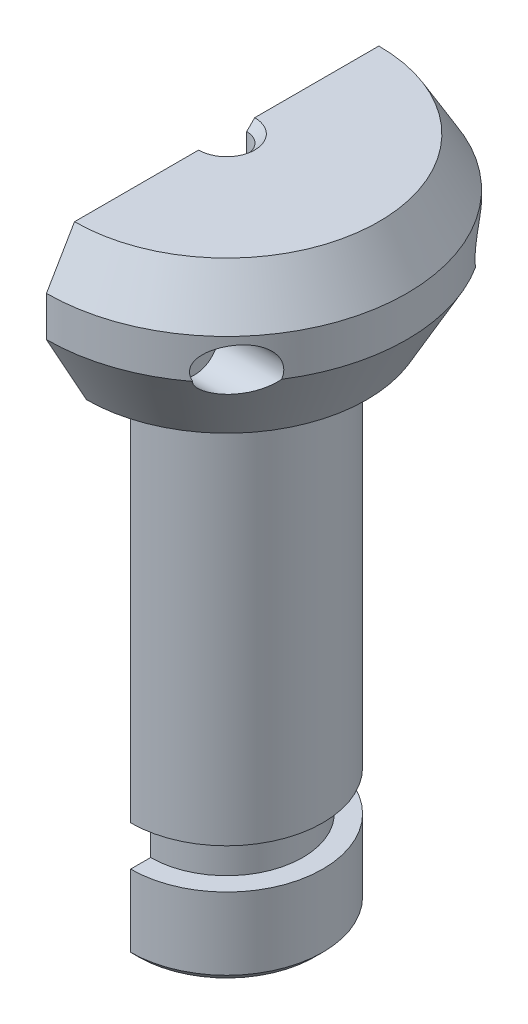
ISO-10303-21;
HEADER;
FILE_DESCRIPTION(('STEP AP214'),'2;1');
FILE_NAME('part.step','',(''),(''),'','','');
FILE_SCHEMA(('AUTOMOTIVE_DESIGN { 1 0 10303 214 1 1 1 1 }'));
ENDSEC;
DATA;
#1=APPLICATION_CONTEXT('core data for automotive mechanical design processes');
#2=APPLICATION_PROTOCOL_DEFINITION('international standard','automotive_design',2000,#1);
#3=PRODUCT_CONTEXT('',#1,'mechanical');
#4=PRODUCT('Part','Part','',(#3));
#5=PRODUCT_RELATED_PRODUCT_CATEGORY('part','',(#4));
#6=PRODUCT_DEFINITION_FORMATION('','',#4);
#7=PRODUCT_DEFINITION_CONTEXT('part definition',#1,'design');
#8=PRODUCT_DEFINITION('design','',#6,#7);
#9=PRODUCT_DEFINITION_SHAPE('','',#8);
#10=(LENGTH_UNIT() NAMED_UNIT(*) SI_UNIT(.MILLI.,.METRE.));
#11=(NAMED_UNIT(*) PLANE_ANGLE_UNIT() SI_UNIT($,.RADIAN.));
#12=(NAMED_UNIT(*) SI_UNIT($,.STERADIAN.) SOLID_ANGLE_UNIT());
#13=UNCERTAINTY_MEASURE_WITH_UNIT(LENGTH_MEASURE(1.E-05),#10,'distance_accuracy_value','');
#14=(GEOMETRIC_REPRESENTATION_CONTEXT(3) GLOBAL_UNCERTAINTY_ASSIGNED_CONTEXT((#13)) GLOBAL_UNIT_ASSIGNED_CONTEXT((#10,
#11,#12)) REPRESENTATION_CONTEXT('',''));
#15=CARTESIAN_POINT('',(0.,0.,0.));
#16=DIRECTION('',(0.,0.,1.));
#17=DIRECTION('',(1.,0.,0.));
#18=AXIS2_PLACEMENT_3D('',#15,#16,#17);
#19=CARTESIAN_POINT('',(0.,-127.,0.));
#20=DIRECTION('',(0.,1.,0.));
#21=DIRECTION('',(0.,0.,1.));
#22=AXIS2_PLACEMENT_3D('',#19,#20,#21);
#23=CYLINDRICAL_SURFACE('',#22,24.);
#24=DIRECTION('',(0.,1.,0.));
#25=VECTOR('',#24,1.);
#26=CARTESIAN_POINT('',(0.,-127.,24.));
#27=LINE('',#26,#25);
#28=CARTESIAN_POINT('',(0.,-125.,24.));
#29=VERTEX_POINT('',#28);
#30=CARTESIAN_POINT('',(0.,-107.,24.));
#31=VERTEX_POINT('',#30);
#32=EDGE_CURVE('E176',#29,#31,#27,.T.);
#33=ORIENTED_EDGE('',*,*,#32,.F.);
#34=CARTESIAN_POINT('',(0.,-125.,0.));
#35=DIRECTION('',(0.,-1.,0.));
#36=DIRECTION('',(0.,0.,-1.));
#37=AXIS2_PLACEMENT_3D('',#34,#35,#36);
#38=CIRCLE('',#37,24.);
#39=CARTESIAN_POINT('',(0.,-125.,-24.));
#40=VERTEX_POINT('',#39);
#41=EDGE_CURVE('E42',#29,#40,#38,.F.);
#42=ORIENTED_EDGE('',*,*,#41,.T.);
#43=DIRECTION('',(0.,1.,0.));
#44=VECTOR('',#43,1.);
#45=CARTESIAN_POINT('',(0.,-127.,-24.));
#46=LINE('',#45,#44);
#47=CARTESIAN_POINT('',(-1.6759110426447E-13,-107.,-24.));
#48=VERTEX_POINT('',#47);
#49=EDGE_CURVE('E200',#40,#48,#46,.T.);
#50=ORIENTED_EDGE('',*,*,#49,.T.);
#51=CARTESIAN_POINT('',(0.,-107.,0.));
#52=DIRECTION('',(0.,-1.,0.));
#53=DIRECTION('',(0.,0.,-1.));
#54=AXIS2_PLACEMENT_3D('',#51,#52,#53);
#55=CIRCLE('',#54,24.);
#56=EDGE_CURVE('E414',#48,#31,#55,.T.);
#57=ORIENTED_EDGE('',*,*,#56,.T.);
#58=EDGE_LOOP('',(#33,#42,#50,#57));
#59=FACE_BOUND('',#58,.T.);
#60=ADVANCED_FACE('F34',(#59),#23,.T.);
#61=CARTESIAN_POINT('',(0.,0.,0.));
#62=DIRECTION('',(0.,1.,0.));
#63=DIRECTION('',(0.,0.,1.));
#64=AXIS2_PLACEMENT_3D('',#61,#62,#63);
#65=PLANE('',#64);
#66=CARTESIAN_POINT('',(0.,0.,0.));
#67=DIRECTION('',(0.,-1.,0.));
#68=DIRECTION('',(0.,0.,-1.));
#69=AXIS2_PLACEMENT_3D('',#66,#67,#68);
#70=CIRCLE('',#69,24.);
#71=CARTESIAN_POINT('',(0.,0.,-24.));
#72=VERTEX_POINT('',#71);
#73=CARTESIAN_POINT('',(0.,0.,24.));
#74=VERTEX_POINT('',#73);
#75=EDGE_CURVE('E175',#72,#74,#70,.T.);
#76=ORIENTED_EDGE('',*,*,#75,.F.);
#77=DIRECTION('',(0.,0.,-1.));
#78=VECTOR('',#77,1.);
#79=CARTESIAN_POINT('',(0.,0.,-45.));
#80=LINE('',#79,#78);
#81=CARTESIAN_POINT('',(0.,0.,-35.));
#82=VERTEX_POINT('',#81);
#83=EDGE_CURVE('E210',#72,#82,#80,.T.);
#84=ORIENTED_EDGE('',*,*,#83,.T.);
#85=CARTESIAN_POINT('',(0.,0.,0.));
#86=DIRECTION('',(0.,1.,0.));
#87=DIRECTION('',(0.,0.,1.));
#88=AXIS2_PLACEMENT_3D('',#85,#86,#87);
#89=CIRCLE('',#88,35.);
#90=CARTESIAN_POINT('',(0.,0.,35.));
#91=VERTEX_POINT('',#90);
#92=EDGE_CURVE('E255',#82,#91,#89,.F.);
#93=ORIENTED_EDGE('',*,*,#92,.T.);
#94=EDGE_CURVE('E212',#91,#74,#80,.T.);
#95=ORIENTED_EDGE('',*,*,#94,.T.);
#96=EDGE_LOOP('',(#76,#84,#93,#95));
#97=FACE_BOUND('',#96,.T.);
#98=ADVANCED_FACE('F209',(#97),#65,.F.);
#99=CARTESIAN_POINT('',(0.,40.,0.));
#100=DIRECTION('',(0.,1.,0.));
#101=DIRECTION('',(0.,0.,1.));
#102=AXIS2_PLACEMENT_3D('',#99,#100,#101);
#103=PLANE('',#102);
#104=DIRECTION('',(0.,0.,-1.));
#105=VECTOR('',#104,1.);
#106=CARTESIAN_POINT('',(0.,40.,-45.));
#107=LINE('',#106,#105);
#108=CARTESIAN_POINT('',(0.,40.,-7.00000000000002));
#109=VERTEX_POINT('',#108);
#110=CARTESIAN_POINT('',(0.,40.,-38.));
#111=VERTEX_POINT('',#110);
#112=EDGE_CURVE('E201',#109,#111,#107,.T.);
#113=ORIENTED_EDGE('',*,*,#112,.F.);
#114=CARTESIAN_POINT('',(0.,40.,0.));
#115=DIRECTION('',(0.,1.,0.));
#116=DIRECTION('',(0.,0.,1.));
#117=AXIS2_PLACEMENT_3D('',#114,#115,#116);
#118=CIRCLE('',#117,7.00000000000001);
#119=CARTESIAN_POINT('',(0.,40.,7.));
#120=VERTEX_POINT('',#119);
#121=EDGE_CURVE('E186',#109,#120,#118,.F.);
#122=ORIENTED_EDGE('',*,*,#121,.T.);
#123=CARTESIAN_POINT('',(0.,40.,38.));
#124=VERTEX_POINT('',#123);
#125=EDGE_CURVE('E204',#124,#120,#107,.T.);
#126=ORIENTED_EDGE('',*,*,#125,.F.);
#127=CARTESIAN_POINT('',(0.,40.,0.));
#128=DIRECTION('',(0.,1.,0.));
#129=DIRECTION('',(0.,0.,1.));
#130=AXIS2_PLACEMENT_3D('',#127,#128,#129);
#131=CIRCLE('',#130,38.);
#132=EDGE_CURVE('E239',#124,#111,#131,.T.);
#133=ORIENTED_EDGE('',*,*,#132,.T.);
#134=EDGE_LOOP('',(#113,#122,#126,#133));
#135=FACE_BOUND('',#134,.T.);
#136=ADVANCED_FACE('F302',(#135),#103,.T.);
#137=CARTESIAN_POINT('',(0.,40.,0.));
#138=DIRECTION('',(0.,-1.,0.));
#139=DIRECTION('',(0.,0.,-1.));
#140=AXIS2_PLACEMENT_3D('',#137,#138,#139);
#141=CYLINDRICAL_SURFACE('',#140,45.);
#142=CARTESIAN_POINT('',(0.,18.0000000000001,0.));
#143=DIRECTION('',(0.,1.,0.));
#144=DIRECTION('',(0.,0.,1.));
#145=AXIS2_PLACEMENT_3D('',#142,#143,#144);
#146=CIRCLE('',#145,45.);
#147=CARTESIAN_POINT('',(37.9286734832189,18.0000000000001,24.2160221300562));
#148=VERTEX_POINT('',#147);
#149=CARTESIAN_POINT('',(37.9286734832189,18.0000000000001,-24.2160221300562));
#150=VERTEX_POINT('',#149);
#151=EDGE_CURVE('E254',#148,#150,#146,.T.);
#152=ORIENTED_EDGE('',*,*,#151,.T.);
#153=CARTESIAN_POINT('',(26.839254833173,20.,-36.12));
#154=CARTESIAN_POINT('',(26.839250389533,19.8728360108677,-36.1200028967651));
#155=CARTESIAN_POINT('',(26.8446033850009,19.7456986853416,-36.1160274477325));
#156=CARTESIAN_POINT('',(26.8658065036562,19.4927422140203,-36.1002579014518));
#157=CARTESIAN_POINT('',(26.8816605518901,19.3669235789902,-36.0884608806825));
#158=CARTESIAN_POINT('',(26.923345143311,19.1177161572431,-36.0573731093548));
#159=CARTESIAN_POINT('',(26.949190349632,18.9943312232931,-36.038071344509));
#160=CARTESIAN_POINT('',(27.0100242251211,18.7511265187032,-35.9924996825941));
#161=CARTESIAN_POINT('',(27.0450181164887,18.6313088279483,-35.9662258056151));
#162=CARTESIAN_POINT('',(27.1612811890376,18.2813795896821,-35.878602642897));
#163=CARTESIAN_POINT('',(27.2544376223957,18.0574369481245,-35.8080057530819));
#164=CARTESIAN_POINT('',(27.4648695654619,17.6293603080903,-35.6468570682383));
#165=CARTESIAN_POINT('',(27.5821543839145,17.4252339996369,-35.5562975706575));
#166=CARTESIAN_POINT('',(27.8106371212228,17.0733272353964,-35.3777529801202));
#167=CARTESIAN_POINT('',(27.9188360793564,16.9221673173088,-35.2924829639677));
#168=CARTESIAN_POINT('',(28.144276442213,16.632353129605,-35.1129672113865));
#169=CARTESIAN_POINT('',(28.2615227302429,16.4937057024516,-35.0187166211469));
#170=CARTESIAN_POINT('',(28.5031901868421,16.2281059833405,-34.8222983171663));
#171=CARTESIAN_POINT('',(28.6276280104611,16.1011827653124,-34.7201120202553));
#172=CARTESIAN_POINT('',(28.881776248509,15.8588361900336,-34.5089889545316));
#173=CARTESIAN_POINT('',(29.0114863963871,15.7434122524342,-34.4000525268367));
#174=CARTESIAN_POINT('',(29.3370237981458,15.4716831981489,-34.1233590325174));
#175=CARTESIAN_POINT('',(29.5351978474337,15.3217521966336,-33.9520791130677));
#176=CARTESIAN_POINT('',(29.9371580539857,15.0443994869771,-33.5981901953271));
#177=CARTESIAN_POINT('',(30.1409466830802,14.9169878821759,-33.4155761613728));
#178=CARTESIAN_POINT('',(30.5519134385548,14.6839776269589,-33.040249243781));
#179=CARTESIAN_POINT('',(30.7590935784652,14.5783924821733,-32.8475301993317));
#180=CARTESIAN_POINT('',(31.1748434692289,14.3889428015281,-32.4532159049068));
#181=CARTESIAN_POINT('',(31.3834130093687,14.3050750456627,-32.2516219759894));
#182=CARTESIAN_POINT('',(31.8050399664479,14.1576282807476,-31.8359700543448));
#183=CARTESIAN_POINT('',(32.0180944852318,14.094539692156,-31.6217349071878));
#184=CARTESIAN_POINT('',(32.4425806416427,13.9918635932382,-31.1860780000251));
#185=CARTESIAN_POINT('',(32.6540121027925,13.9522786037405,-30.9646554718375));
#186=CARTESIAN_POINT('',(33.0735626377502,13.8976226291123,-30.5161213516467));
#187=CARTESIAN_POINT('',(33.2816848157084,13.8825271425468,-30.2890156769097));
#188=CARTESIAN_POINT('',(33.6933198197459,13.8780557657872,-29.8304383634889));
#189=CARTESIAN_POINT('',(33.8968337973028,13.8886733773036,-29.598967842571));
#190=CARTESIAN_POINT('',(34.2569214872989,13.9322022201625,-29.1808714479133));
#191=CARTESIAN_POINT('',(34.4146270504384,13.9601425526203,-28.9946951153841));
#192=CARTESIAN_POINT('',(34.7252439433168,14.0341405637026,-28.6219538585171));
#193=CARTESIAN_POINT('',(34.878156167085,14.080194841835,-28.4353890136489));
#194=CARTESIAN_POINT('',(35.1781362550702,14.1912378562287,-28.0634241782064));
#195=CARTESIAN_POINT('',(35.3252086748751,14.2562114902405,-27.8780233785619));
#196=CARTESIAN_POINT('',(35.6125825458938,14.4059319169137,-27.5099696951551));
#197=CARTESIAN_POINT('',(35.7528853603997,14.4906747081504,-27.3273162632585));
#198=CARTESIAN_POINT('',(35.999110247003,14.662194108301,-27.0018014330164));
#199=CARTESIAN_POINT('',(36.1064208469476,14.7453852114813,-26.8580961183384));
#200=CARTESIAN_POINT('',(36.3152517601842,14.9253331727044,-26.5750521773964));
#201=CARTESIAN_POINT('',(36.4167732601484,15.0220872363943,-26.435712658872));
#202=CARTESIAN_POINT('',(36.6132847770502,15.2292419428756,-26.1628673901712));
#203=CARTESIAN_POINT('',(36.7082793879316,15.3396328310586,-26.0293575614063));
#204=CARTESIAN_POINT('',(36.8910910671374,15.5740803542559,-25.7696064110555));
#205=CARTESIAN_POINT('',(36.9789091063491,15.6981351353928,-25.643364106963));
#206=CARTESIAN_POINT('',(37.1339321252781,15.9398447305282,-25.4182384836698));
#207=CARTESIAN_POINT('',(37.2022454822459,16.0556276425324,-25.3181057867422));
#208=CARTESIAN_POINT('',(37.3327102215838,16.2965156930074,-25.1253316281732));
#209=CARTESIAN_POINT('',(37.3948626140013,16.4216192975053,-25.0326889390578));
#210=CARTESIAN_POINT('',(37.5125732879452,16.6807052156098,-24.8559475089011));
#211=CARTESIAN_POINT('',(37.5681304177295,16.8146890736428,-24.7718502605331));
#212=CARTESIAN_POINT('',(37.672178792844,17.0907914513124,-24.6133283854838));
#213=CARTESIAN_POINT('',(37.7206734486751,17.2329059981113,-24.5388990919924));
#214=CARTESIAN_POINT('',(37.8104768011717,17.5253085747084,-24.4003013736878));
#215=CARTESIAN_POINT('',(37.8517433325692,17.6756382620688,-24.3361933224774));
#216=CARTESIAN_POINT('',(37.926383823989,17.9826823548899,-24.2197068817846));
#217=CARTESIAN_POINT('',(37.9597576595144,18.1393968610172,-24.1673286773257));
#218=CARTESIAN_POINT('',(38.0182890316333,18.4579258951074,-24.0751466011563));
#219=CARTESIAN_POINT('',(38.0434492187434,18.6197387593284,-24.0353386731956));
#220=CARTESIAN_POINT('',(38.0853208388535,18.9471213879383,-23.9689358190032));
#221=CARTESIAN_POINT('',(38.1020331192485,19.1126907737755,-23.9423395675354));
#222=CARTESIAN_POINT('',(38.1256244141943,19.4296729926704,-23.904752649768));
#223=CARTESIAN_POINT('',(38.1333090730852,19.5808760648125,-23.892484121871));
#224=CARTESIAN_POINT('',(38.141616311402,19.8839689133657,-23.8792204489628));
#225=CARTESIAN_POINT('',(38.1422391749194,20.0358586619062,-23.8782248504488));
#226=CARTESIAN_POINT('',(38.1364184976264,20.3391101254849,-23.8875200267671));
#227=CARTESIAN_POINT('',(38.1299770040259,20.4904719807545,-23.8978075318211));
#228=CARTESIAN_POINT('',(38.1100840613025,20.7915583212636,-23.9295182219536));
#229=CARTESIAN_POINT('',(38.0966326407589,20.9412828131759,-23.9509413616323));
#230=CARTESIAN_POINT('',(38.063449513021,21.2325441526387,-24.0036401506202));
#231=CARTESIAN_POINT('',(38.0439657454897,21.3741800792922,-24.0345264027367));
#232=CARTESIAN_POINT('',(37.9987319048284,21.65401356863,-24.1059776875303));
#233=CARTESIAN_POINT('',(37.9729797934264,21.7922099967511,-24.1465458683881));
#234=CARTESIAN_POINT('',(37.915407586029,22.064216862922,-24.2368465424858));
#235=CARTESIAN_POINT('',(37.8835895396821,22.1980287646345,-24.2865759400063));
#236=CARTESIAN_POINT('',(37.8140890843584,22.4606064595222,-24.3946468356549));
#237=CARTESIAN_POINT('',(37.7764044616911,22.5893703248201,-24.4529915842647));
#238=CARTESIAN_POINT('',(37.6937539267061,22.8463487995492,-24.580213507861));
#239=CARTESIAN_POINT('',(37.6485517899,22.9743216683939,-24.6494258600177));
#240=CARTESIAN_POINT('',(37.5523723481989,23.2234478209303,-24.7957054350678));
#241=CARTESIAN_POINT('',(37.5013929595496,23.3445986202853,-24.8727754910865));
#242=CARTESIAN_POINT('',(37.3402824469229,23.6970009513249,-25.1145518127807));
#243=CARTESIAN_POINT('',(37.2219275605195,23.917361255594,-25.2899041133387));
#244=CARTESIAN_POINT('',(36.9522142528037,24.3484143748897,-25.6826107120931));
#245=CARTESIAN_POINT('',(36.7986636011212,24.5554271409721,-25.9024603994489));
#246=CARTESIAN_POINT('',(36.4717812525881,24.929271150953,-26.3607380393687));
#247=CARTESIAN_POINT('',(36.2984395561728,25.0960819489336,-26.5991753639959));
#248=CARTESIAN_POINT('',(35.9049631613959,25.4148062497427,-27.128574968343));
#249=CARTESIAN_POINT('',(35.681856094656,25.5595309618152,-27.4216403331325));
#250=CARTESIAN_POINT('',(35.2182487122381,25.7978263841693,-28.0145855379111));
#251=CARTESIAN_POINT('',(34.977737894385,25.8913659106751,-28.314469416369));
#252=CARTESIAN_POINT('',(34.4314532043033,26.0454858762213,-28.9775087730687));
#253=CARTESIAN_POINT('',(34.1226013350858,26.0949780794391,-29.3406901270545));
#254=CARTESIAN_POINT('',(33.49175925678,26.1302816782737,-30.058790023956));
#255=CARTESIAN_POINT('',(33.1697592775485,26.1160448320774,-30.4137021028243));
#256=CARTESIAN_POINT('',(32.646312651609,26.0459712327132,-30.9726080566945));
#257=CARTESIAN_POINT('',(32.4470837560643,26.0086272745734,-31.1812296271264));
#258=CARTESIAN_POINT('',(32.0470640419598,25.9130179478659,-31.5922114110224));
#259=CARTESIAN_POINT('',(31.8462729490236,25.8547488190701,-31.7945704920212));
#260=CARTESIAN_POINT('',(31.4442761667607,25.7177740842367,-32.1921968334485));
#261=CARTESIAN_POINT('',(31.2430702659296,25.6390497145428,-32.3874573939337));
#262=CARTESIAN_POINT('',(30.8418210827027,25.4614209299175,-32.7697852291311));
#263=CARTESIAN_POINT('',(30.6417776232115,25.3625196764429,-32.9568537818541));
#264=CARTESIAN_POINT('',(30.2667310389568,25.1566338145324,-33.3013870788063));
#265=CARTESIAN_POINT('',(30.0914352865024,25.0517990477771,-33.4598192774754));
#266=CARTESIAN_POINT('',(29.7443530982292,24.8257316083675,-33.7687343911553));
#267=CARTESIAN_POINT('',(29.5725671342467,24.7044967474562,-33.9192162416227));
#268=CARTESIAN_POINT('',(29.2345361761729,24.4452242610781,-34.2109870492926));
#269=CARTESIAN_POINT('',(29.0682823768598,24.3072151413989,-34.3522909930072));
#270=CARTESIAN_POINT('',(28.7433761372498,24.0134184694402,-34.6246047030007));
#271=CARTESIAN_POINT('',(28.5847196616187,23.8576405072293,-34.7556199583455));
#272=CARTESIAN_POINT('',(28.2434569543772,23.4899744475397,-35.0337793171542));
#273=CARTESIAN_POINT('',(28.0634581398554,23.2733373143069,-35.1779521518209));
#274=CARTESIAN_POINT('',(27.7273109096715,22.8096115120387,-35.4435041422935));
#275=CARTESIAN_POINT('',(27.5711319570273,22.5625625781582,-35.5649125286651));
#276=CARTESIAN_POINT('',(27.3254155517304,22.0964796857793,-35.7538825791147));
#277=CARTESIAN_POINT('',(27.2287933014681,21.8837152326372,-35.8274127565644));
#278=CARTESIAN_POINT('',(27.1050637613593,21.5522101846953,-35.9209993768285));
#279=CARTESIAN_POINT('',(27.0673688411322,21.4397112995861,-35.9493995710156));
#280=CARTESIAN_POINT('',(26.9998711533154,21.2110527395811,-36.0001213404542));
#281=CARTESIAN_POINT('',(26.9700658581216,21.0948942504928,-36.0224448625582));
#282=CARTESIAN_POINT('',(26.9101966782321,20.8181489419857,-36.0672038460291));
#283=CARTESIAN_POINT('',(26.8837321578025,20.6563111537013,-36.0869146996));
#284=CARTESIAN_POINT('',(26.8482637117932,20.3296340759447,-36.1133112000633));
#285=CARTESIAN_POINT('',(26.839260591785,20.1647946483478,-36.1199962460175));
#286=CARTESIAN_POINT('',(26.839254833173,20.,-36.12));
#287=B_SPLINE_CURVE_WITH_KNOTS('',3,(#153,#154,#155,#156,#157,#158,#159,#160,#161,#162,#163,
#164,#165,#166,#167,#168,#169,#170,#171,#172,#173,#174,#175,#176,#177,#178,#179,#180,#181,#182,
#183,#184,#185,#186,#187,#188,#189,#190,#191,#192,#193,#194,#195,#196,#197,#198,#199,#200,#201,
#202,#203,#204,#205,#206,#207,#208,#209,#210,#211,#212,#213,#214,#215,#216,#217,#218,#219,#220,
#221,#222,#223,#224,#225,#226,#227,#228,#229,#230,#231,#232,#233,#234,#235,#236,#237,#238,#239,
#240,#241,#242,#243,#244,#245,#246,#247,#248,#249,#250,#251,#252,#253,#254,#255,#256,#257,#258,
#259,#260,#261,#262,#263,#264,#265,#266,#267,#268,#269,#270,#271,#272,#273,#274,#275,#276,#277,
#278,#279,#280,#281,#282,#283,#284,#285,#286),.UNSPECIFIED.,.T.,.F.,(4,2,2,2,2,2,2,2,2,2,2,2,2,
2,2,2,2,2,2,2,2,2,2,2,2,2,2,2,2,2,2,2,2,2,2,2,2,2,2,2,2,2,2,2,2,2,2,2,2,2,2,2,2,2,2,2,2,2,2,2,2,
2,2,2,2,2,4),(0.,0.381274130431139,0.762690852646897,1.14466948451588,1.52686663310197,
2.28109690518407,3.03561870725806,3.64833044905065,4.26137524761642,4.87590161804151,
5.49039695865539,6.39453131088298,7.29907027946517,8.20416728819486,9.10913002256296,
10.0341330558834,10.9592352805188,11.8834113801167,12.8073539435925,13.5434669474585,
14.279441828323,15.0148308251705,15.7500711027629,16.342641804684,16.9350905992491,
17.5271180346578,18.1190652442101,18.6214433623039,19.1237389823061,19.6261221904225,
20.1282619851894,20.6332399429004,21.1382258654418,21.6430486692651,22.1478208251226,
22.6029335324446,23.0580279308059,23.5129904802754,23.9679511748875,24.406256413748,
24.8447043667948,25.2830044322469,25.721470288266,26.1780222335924,26.6347393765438,
27.547624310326,28.5601432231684,29.573176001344,30.7560835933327,31.9397110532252,
33.3725835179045,34.8065408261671,35.6784428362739,36.5505016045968,37.4233631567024,
38.2960880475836,39.0709555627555,39.8459265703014,40.6195985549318,41.392854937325,
42.3395078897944,43.2849368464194,44.0168954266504,44.382489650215,44.7479666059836,
45.2420454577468,45.73614710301),.UNSPECIFIED.);
#288=CARTESIAN_POINT('',(27.2856542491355,18.0000000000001,-35.7839778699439));
#289=VERTEX_POINT('',#288);
#290=EDGE_CURVE('E307',#150,#289,#287,.T.);
#291=ORIENTED_EDGE('',*,*,#290,.T.);
#292=CARTESIAN_POINT('',(0.,18.0000000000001,-45.));
#293=VERTEX_POINT('',#292);
#294=EDGE_CURVE('E250',#289,#293,#146,.T.);
#295=ORIENTED_EDGE('',*,*,#294,.T.);
#296=DIRECTION('',(0.,1.,0.));
#297=VECTOR('',#296,1.);
#298=CARTESIAN_POINT('',(0.,0.,-45.));
#299=LINE('',#298,#297);
#300=CARTESIAN_POINT('',(0.,27.9999999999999,-45.));
#301=VERTEX_POINT('',#300);
#302=EDGE_CURVE('E230',#293,#301,#299,.T.);
#303=ORIENTED_EDGE('',*,*,#302,.T.);
#304=CARTESIAN_POINT('',(0.,27.9999999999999,0.));
#305=DIRECTION('',(0.,1.,0.));
#306=DIRECTION('',(0.,0.,1.));
#307=AXIS2_PLACEMENT_3D('',#304,#305,#306);
#308=CIRCLE('',#307,45.);
#309=CARTESIAN_POINT('',(0.,27.9999999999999,45.));
#310=VERTEX_POINT('',#309);
#311=EDGE_CURVE('E245',#301,#310,#308,.F.);
#312=ORIENTED_EDGE('',*,*,#311,.T.);
#313=DIRECTION('',(0.,1.,0.));
#314=VECTOR('',#313,1.);
#315=CARTESIAN_POINT('',(0.,0.,45.));
#316=LINE('',#315,#314);
#317=CARTESIAN_POINT('',(0.,18.0000000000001,45.));
#318=VERTEX_POINT('',#317);
#319=EDGE_CURVE('E220',#318,#310,#316,.T.);
#320=ORIENTED_EDGE('',*,*,#319,.F.);
#321=CARTESIAN_POINT('',(27.2856542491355,18.0000000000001,35.7839778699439));
#322=VERTEX_POINT('',#321);
#323=EDGE_CURVE('E251',#318,#322,#146,.T.);
#324=ORIENTED_EDGE('',*,*,#323,.T.);
#325=CARTESIAN_POINT('',(38.1411274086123,20.,23.88));
#326=CARTESIAN_POINT('',(38.1411279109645,19.8485614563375,23.8799988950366));
#327=CARTESIAN_POINT('',(38.1376061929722,19.6971363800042,23.8856267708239));
#328=CARTESIAN_POINT('',(38.1235474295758,19.3953916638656,23.9080595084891));
#329=CARTESIAN_POINT('',(38.1130082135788,19.2450723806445,23.9248678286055));
#330=CARTESIAN_POINT('',(38.0849844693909,18.9465809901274,23.9694524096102));
#331=CARTESIAN_POINT('',(38.0674932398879,18.79841109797,23.9972392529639));
#332=CARTESIAN_POINT('',(38.0256984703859,18.5053794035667,24.0634117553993));
#333=CARTESIAN_POINT('',(38.0013922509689,18.3605189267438,24.1018015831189));
#334=CARTESIAN_POINT('',(37.9462563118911,18.0756467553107,24.1885150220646));
#335=CARTESIAN_POINT('',(37.9154493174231,17.9356200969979,24.236804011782));
#336=CARTESIAN_POINT('',(37.8474814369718,17.6607167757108,24.3428040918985));
#337=CARTESIAN_POINT('',(37.8103181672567,17.5258420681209,24.4005187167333));
#338=CARTESIAN_POINT('',(37.7299351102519,17.2621276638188,24.5246295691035));
#339=CARTESIAN_POINT('',(37.6867186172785,17.1332847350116,24.5910210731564));
#340=CARTESIAN_POINT('',(37.5944936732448,16.8821431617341,24.7317837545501));
#341=CARTESIAN_POINT('',(37.5454830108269,16.7598470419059,24.8061579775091));
#342=CARTESIAN_POINT('',(37.4396687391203,16.5170191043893,24.9655913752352));
#343=CARTESIAN_POINT('',(37.3826139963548,16.3968131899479,25.0509804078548));
#344=CARTESIAN_POINT('',(37.2629067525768,16.1645726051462,25.2286997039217));
#345=CARTESIAN_POINT('',(37.2002522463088,16.052540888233,25.3210324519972));
#346=CARTESIAN_POINT('',(37.0044778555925,15.7292620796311,25.6070656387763));
#347=CARTESIAN_POINT('',(36.863482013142,15.5306831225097,25.8098998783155));
#348=CARTESIAN_POINT('',(36.5431708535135,15.1439992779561,26.2618252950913));
#349=CARTESIAN_POINT('',(36.3612521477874,14.9610621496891,26.5134458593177));
#350=CARTESIAN_POINT('',(35.9784429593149,14.6399620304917,27.0306342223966));
#351=CARTESIAN_POINT('',(35.7775358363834,14.5018387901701,27.2962141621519));
#352=CARTESIAN_POINT('',(35.4171245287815,14.3001450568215,27.7612885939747));
#353=CARTESIAN_POINT('',(35.2611080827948,14.2265145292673,27.9592418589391));
#354=CARTESIAN_POINT('',(34.9422738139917,14.1010689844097,28.3566987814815));
#355=CARTESIAN_POINT('',(34.7794535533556,14.0492618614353,28.5562029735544));
#356=CARTESIAN_POINT('',(34.4481100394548,13.9664255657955,28.9550519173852));
#357=CARTESIAN_POINT('',(34.2795816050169,13.9354158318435,29.1543963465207));
#358=CARTESIAN_POINT('',(33.9380436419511,13.8932116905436,29.5512729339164));
#359=CARTESIAN_POINT('',(33.7650344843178,13.8820156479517,29.7488052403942));
#360=CARTESIAN_POINT('',(33.413217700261,13.878458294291,30.1434517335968));
#361=CARTESIAN_POINT('',(33.2343638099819,13.8863455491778,30.3405265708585));
#362=CARTESIAN_POINT('',(32.8740050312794,13.9206126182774,30.7306087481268));
#363=CARTESIAN_POINT('',(32.6924999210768,13.9469939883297,30.9236157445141));
#364=CARTESIAN_POINT('',(32.3275763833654,14.0175889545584,31.3049120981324));
#365=CARTESIAN_POINT('',(32.144156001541,14.0618229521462,31.4931957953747));
#366=CARTESIAN_POINT('',(31.7766153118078,14.1675866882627,31.8640058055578));
#367=CARTESIAN_POINT('',(31.592495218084,14.2291114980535,32.0465337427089));
#368=CARTESIAN_POINT('',(31.1877267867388,14.383139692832,32.4410335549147));
#369=CARTESIAN_POINT('',(30.9671247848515,14.4793755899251,32.6516081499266));
#370=CARTESIAN_POINT('',(30.5281191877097,14.6962373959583,33.0624312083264));
#371=CARTESIAN_POINT('',(30.3097164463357,14.8168724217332,33.2626757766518));
#372=CARTESIAN_POINT('',(29.8778931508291,15.0827570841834,33.6510870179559));
#373=CARTESIAN_POINT('',(29.664465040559,15.2279661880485,33.8392728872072));
#374=CARTESIAN_POINT('',(29.2454727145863,15.5440866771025,34.2020324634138));
#375=CARTESIAN_POINT('',(29.0399023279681,15.7149773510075,34.3766169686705));
#376=CARTESIAN_POINT('',(28.6264608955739,16.0974235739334,34.7217974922));
#377=CARTESIAN_POINT('',(28.4194682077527,16.3110081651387,34.8912244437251));
#378=CARTESIAN_POINT('',(28.0271000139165,16.7723434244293,35.2071702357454));
#379=CARTESIAN_POINT('',(27.8416944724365,17.0200455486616,35.3537210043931));
#380=CARTESIAN_POINT('',(27.5415528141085,17.4931303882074,35.5877904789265));
#381=CARTESIAN_POINT('',(27.4202517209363,17.7113664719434,35.6811988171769));
#382=CARTESIAN_POINT('',(27.2059520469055,18.1694777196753,35.8448653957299));
#383=CARTESIAN_POINT('',(27.1129082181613,18.4093174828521,35.9151606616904));
#384=CARTESIAN_POINT('',(26.9785965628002,18.8585507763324,36.0161218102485));
#385=CARTESIAN_POINT('',(26.9307868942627,19.0648278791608,36.0518294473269));
#386=CARTESIAN_POINT('',(26.8636330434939,19.4844793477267,36.1018979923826));
#387=CARTESIAN_POINT('',(26.8442636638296,19.6978472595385,36.1162777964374));
#388=CARTESIAN_POINT('',(26.8359528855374,20.1259495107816,36.1224538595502));
#389=CARTESIAN_POINT('',(26.8470720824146,20.3406857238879,36.1142051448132));
#390=CARTESIAN_POINT('',(26.8986700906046,20.7645981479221,36.075788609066));
#391=CARTESIAN_POINT('',(26.9391705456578,20.9737701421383,36.045604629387));
#392=CARTESIAN_POINT('',(27.0571996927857,21.4250206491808,35.957118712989));
#393=CARTESIAN_POINT('',(27.140789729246,21.6645846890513,35.8941879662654));
#394=CARTESIAN_POINT('',(27.3371294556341,22.1235091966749,35.7448818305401));
#395=CARTESIAN_POINT('',(27.449931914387,22.3428321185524,35.6584640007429));
#396=CARTESIAN_POINT('',(27.7543610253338,22.8574822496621,35.422412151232));
#397=CARTESIAN_POINT('',(27.958232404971,23.1406411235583,35.2620800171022));
#398=CARTESIAN_POINT('',(28.2847312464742,23.5327136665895,34.9999128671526));
#399=CARTESIAN_POINT('',(28.3971951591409,23.6581219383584,34.9087608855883));
#400=CARTESIAN_POINT('',(28.6276724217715,23.8986329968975,34.7200009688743));
#401=CARTESIAN_POINT('',(28.7456856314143,24.0137360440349,34.6223931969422));
#402=CARTESIAN_POINT('',(29.0470149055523,24.2900249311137,34.3704330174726));
#403=CARTESIAN_POINT('',(29.2330536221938,24.4449217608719,34.2124404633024));
#404=CARTESIAN_POINT('',(29.6116645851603,24.7335623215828,33.885277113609));
#405=CARTESIAN_POINT('',(29.804239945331,24.8672957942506,33.7161009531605));
#406=CARTESIAN_POINT('',(30.1936692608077,25.1144790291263,33.367808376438));
#407=CARTESIAN_POINT('',(30.3905264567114,25.227912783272,33.1886842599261));
#408=CARTESIAN_POINT('',(30.7865013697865,25.4347717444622,32.821703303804));
#409=CARTESIAN_POINT('',(30.9856187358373,25.5282000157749,32.6338478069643));
#410=CARTESIAN_POINT('',(31.3906952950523,25.6976496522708,32.2444653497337));
#411=CARTESIAN_POINT('',(31.5966788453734,25.7730571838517,32.0426965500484));
#412=CARTESIAN_POINT('',(32.0080597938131,25.9023838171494,31.6317663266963));
#413=CARTESIAN_POINT('',(32.2134571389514,25.9563010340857,31.4226042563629));
#414=CARTESIAN_POINT('',(32.6221763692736,26.0419460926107,30.9980704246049));
#415=CARTESIAN_POINT('',(32.825499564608,26.0736889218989,30.7827029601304));
#416=CARTESIAN_POINT('',(33.2288830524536,26.1140827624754,30.3468196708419));
#417=CARTESIAN_POINT('',(33.4289438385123,26.1227372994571,30.126304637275));
#418=CARTESIAN_POINT('',(33.7987921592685,26.1162076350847,29.7104148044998));
#419=CARTESIAN_POINT('',(33.9691396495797,26.1039707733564,29.5154903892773));
#420=CARTESIAN_POINT('',(34.3054151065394,26.0601775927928,29.1239602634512));
#421=CARTESIAN_POINT('',(34.4713430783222,26.0286212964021,28.9273545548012));
#422=CARTESIAN_POINT('',(34.7976113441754,25.9452288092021,28.5340407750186));
#423=CARTESIAN_POINT('',(34.9579559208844,25.8934085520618,28.3373329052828));
#424=CARTESIAN_POINT('',(35.2720434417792,25.7684781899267,27.945410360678));
#425=CARTESIAN_POINT('',(35.4257878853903,25.6953729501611,27.7501953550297));
#426=CARTESIAN_POINT('',(35.6947449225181,25.5441872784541,27.4029758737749));
#427=CARTESIAN_POINT('',(35.8114022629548,25.4701892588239,27.2503068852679));
#428=CARTESIAN_POINT('',(36.0390629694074,25.3077398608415,26.9484997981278));
#429=CARTESIAN_POINT('',(36.1500675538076,25.2192916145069,26.7993609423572));
#430=CARTESIAN_POINT('',(36.3656133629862,25.0277192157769,26.5061361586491));
#431=CARTESIAN_POINT('',(36.4701599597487,24.924607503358,26.3620460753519));
#432=CARTESIAN_POINT('',(36.6721032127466,24.7035211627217,26.0803922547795));
#433=CARTESIAN_POINT('',(36.7695009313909,24.5855487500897,25.9428275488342));
#434=CARTESIAN_POINT('',(36.941276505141,24.3550388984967,25.6974858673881));
#435=CARTESIAN_POINT('',(37.0168353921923,24.2446864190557,25.5884797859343));
#436=CARTESIAN_POINT('',(37.1618486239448,24.0138010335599,25.3774189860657));
#437=CARTESIAN_POINT('',(37.2313039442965,23.89326976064,25.2753631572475));
#438=CARTESIAN_POINT('',(37.3636387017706,23.6423485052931,25.0793241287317));
#439=CARTESIAN_POINT('',(37.4265163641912,23.5119558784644,24.9853431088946));
#440=CARTESIAN_POINT('',(37.5451846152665,23.2418946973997,24.806664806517));
#441=CARTESIAN_POINT('',(37.6009752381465,23.1022261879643,24.7219674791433));
#442=CARTESIAN_POINT('',(37.7053580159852,22.8133808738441,24.5624740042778));
#443=CARTESIAN_POINT('',(37.7538980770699,22.6641453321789,24.4877498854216));
#444=CARTESIAN_POINT('',(37.8428699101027,22.3580479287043,24.3500292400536));
#445=CARTESIAN_POINT('',(37.8833026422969,22.2011869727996,24.2870313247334));
#446=CARTESIAN_POINT('',(37.9556143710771,21.8813040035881,24.1738669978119));
#447=CARTESIAN_POINT('',(37.9875080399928,21.7182931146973,24.1236785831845));
#448=CARTESIAN_POINT('',(38.0424987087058,21.3873308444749,24.0368661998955));
#449=CARTESIAN_POINT('',(38.0656000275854,21.2193819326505,24.0002355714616));
#450=CARTESIAN_POINT('',(38.1031019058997,20.8771514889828,23.9406535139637));
#451=CARTESIAN_POINT('',(38.117348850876,20.7028109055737,23.9179436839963));
#452=CARTESIAN_POINT('',(38.1363610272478,20.3523074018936,23.8876180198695));
#453=CARTESIAN_POINT('',(38.1411268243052,20.1761445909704,23.8800012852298));
#454=CARTESIAN_POINT('',(38.1411274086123,20.,23.88));
#455=B_SPLINE_CURVE_WITH_KNOTS('',3,(#325,#326,#327,#328,#329,#330,#331,#332,#333,#334,#335,
#336,#337,#338,#339,#340,#341,#342,#343,#344,#345,#346,#347,#348,#349,#350,#351,#352,#353,#354,
#355,#356,#357,#358,#359,#360,#361,#362,#363,#364,#365,#366,#367,#368,#369,#370,#371,#372,#373,
#374,#375,#376,#377,#378,#379,#380,#381,#382,#383,#384,#385,#386,#387,#388,#389,#390,#391,#392,
#393,#394,#395,#396,#397,#398,#399,#400,#401,#402,#403,#404,#405,#406,#407,#408,#409,#410,#411,
#412,#413,#414,#415,#416,#417,#418,#419,#420,#421,#422,#423,#424,#425,#426,#427,#428,#429,#430,
#431,#432,#433,#434,#435,#436,#437,#438,#439,#440,#441,#442,#443,#444,#445,#446,#447,#448,#449,
#450,#451,#452,#453,#454),.UNSPECIFIED.,.T.,.F.,(4,2,2,2,2,2,2,2,2,2,2,2,2,2,2,2,2,2,2,2,2,2,2,
2,2,2,2,2,2,2,2,2,2,2,2,2,2,2,2,2,2,2,2,2,2,2,2,2,2,2,2,2,2,2,2,2,2,2,2,2,2,2,2,2,4),(0.,
0.454147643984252,0.9084358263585,1.36316298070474,1.81806916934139,2.27141070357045,
2.72492262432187,3.17818868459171,3.63162829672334,4.10543218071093,4.57940641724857,
5.52679163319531,6.60405158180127,7.68226448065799,8.46903228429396,9.25608444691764,
10.0438712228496,10.8315929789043,11.6296301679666,12.4277345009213,13.2267534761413,
14.025544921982,14.9838183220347,15.9424504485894,16.8995165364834,17.8558148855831,
18.8802030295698,19.9031484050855,20.7002436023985,21.4960556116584,22.1375260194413,
22.7784277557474,23.4206041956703,24.0632541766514,24.8431723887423,25.6245093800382,
26.7697000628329,27.34400243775,27.9182902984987,28.78427680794,29.6506818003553,
30.5177670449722,31.3847193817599,32.2779640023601,33.1712869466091,34.064005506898,
34.9565877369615,35.7333589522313,36.5101292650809,37.2862900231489,38.0622735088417,
38.6793969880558,39.2963868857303,39.9128564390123,40.529234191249,41.0463367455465,
41.5633564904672,42.0805153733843,42.5976717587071,43.118381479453,43.6390294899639,
44.1587770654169,44.6782689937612,45.2065388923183,45.7347772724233),.UNSPECIFIED.);
#456=EDGE_CURVE('E213',#322,#148,#455,.T.);
#457=ORIENTED_EDGE('',*,*,#456,.T.);
#458=EDGE_LOOP('',(#152,#291,#295,#303,#312,#320,#324,#457));
#459=FACE_BOUND('',#458,.T.);
#460=ADVANCED_FACE('F297',(#459),#141,.T.);
#461=CARTESIAN_POINT('',(0.,40.,0.));
#462=DIRECTION('',(0.,-1.,0.));
#463=DIRECTION('',(0.,0.,-1.));
#464=AXIS2_PLACEMENT_3D('',#461,#462,#463);
#465=CYLINDRICAL_SURFACE('',#464,5.);
#466=DIRECTION('',(0.,-1.,0.));
#467=VECTOR('',#466,1.);
#468=CARTESIAN_POINT('',(0.,40.,-5.));
#469=LINE('',#468,#467);
#470=CARTESIAN_POINT('',(0.,-125.,-5.));
#471=VERTEX_POINT('',#470);
#472=CARTESIAN_POINT('',(0.,38.,-5.));
#473=VERTEX_POINT('',#472);
#474=EDGE_CURVE('E232',#471,#473,#469,.F.);
#475=ORIENTED_EDGE('',*,*,#474,.F.);
#476=CARTESIAN_POINT('',(0.,-125.,0.));
#477=DIRECTION('',(0.,-1.,0.));
#478=DIRECTION('',(0.,0.,-1.));
#479=AXIS2_PLACEMENT_3D('',#476,#477,#478);
#480=CIRCLE('',#479,5.);
#481=CARTESIAN_POINT('',(0.,-125.,4.99999999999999));
#482=VERTEX_POINT('',#481);
#483=EDGE_CURVE('E385',#471,#482,#480,.T.);
#484=ORIENTED_EDGE('',*,*,#483,.T.);
#485=DIRECTION('',(0.,-1.,0.));
#486=VECTOR('',#485,1.);
#487=CARTESIAN_POINT('',(0.,40.,5.));
#488=LINE('',#487,#486);
#489=CARTESIAN_POINT('',(0.,38.,5.));
#490=VERTEX_POINT('',#489);
#491=EDGE_CURVE('E236',#490,#482,#488,.T.);
#492=ORIENTED_EDGE('',*,*,#491,.F.);
#493=CARTESIAN_POINT('',(0.,38.,0.));
#494=DIRECTION('',(0.,1.,0.));
#495=DIRECTION('',(0.,0.,1.));
#496=AXIS2_PLACEMENT_3D('',#493,#494,#495);
#497=CIRCLE('',#496,5.);
#498=EDGE_CURVE('E389',#490,#473,#497,.T.);
#499=ORIENTED_EDGE('',*,*,#498,.T.);
#500=EDGE_LOOP('',(#475,#484,#492,#499));
#501=FACE_BOUND('',#500,.T.);
#502=ADVANCED_FACE('F301',(#501),#465,.F.);
#503=CARTESIAN_POINT('',(0.,0.,-45.));
#504=DIRECTION('',(1.,0.,0.));
#505=DIRECTION('',(0.,0.,-1.));
#506=AXIS2_PLACEMENT_3D('',#503,#504,#505);
#507=PLANE('',#506);
#508=CARTESIAN_POINT('',(0.,20.,-30.));
#509=DIRECTION('',(1.,0.,0.));
#510=DIRECTION('',(0.,0.,-1.));
#511=AXIS2_PLACEMENT_3D('',#508,#509,#510);
#512=CIRCLE('',#511,2.9);
#513=CARTESIAN_POINT('',(0.,20.,-32.9));
#514=VERTEX_POINT('',#513);
#515=EDGE_CURVE('E419',#514,#514,#512,.T.);
#516=ORIENTED_EDGE('',*,*,#515,.T.);
#517=EDGE_LOOP('',(#516));
#518=FACE_BOUND('',#517,.T.);
#519=ORIENTED_EDGE('',*,*,#49,.F.);
#520=DIRECTION('',(0.,0.707106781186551,-0.707106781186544));
#521=VECTOR('',#520,1.);
#522=CARTESIAN_POINT('',(0.,-149.,0.));
#523=LINE('',#522,#521);
#524=CARTESIAN_POINT('',(0.,-127.,-22.));
#525=VERTEX_POINT('',#524);
#526=EDGE_CURVE('E11',#40,#525,#523,.F.);
#527=ORIENTED_EDGE('',*,*,#526,.T.);
#528=DIRECTION('',(0.,0.,-1.));
#529=VECTOR('',#528,1.);
#530=CARTESIAN_POINT('',(0.,-127.,-5.));
#531=LINE('',#530,#529);
#532=CARTESIAN_POINT('',(0.,-127.,-6.99999999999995));
#533=VERTEX_POINT('',#532);
#534=EDGE_CURVE('E181',#533,#525,#531,.T.);
#535=ORIENTED_EDGE('',*,*,#534,.F.);
#536=DIRECTION('',(0.,0.707106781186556,0.707106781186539));
#537=VECTOR('',#536,1.);
#538=CARTESIAN_POINT('',(0.,-120.,0.));
#539=LINE('',#538,#537);
#540=EDGE_CURVE('E392',#533,#471,#539,.T.);
#541=ORIENTED_EDGE('',*,*,#540,.T.);
#542=ORIENTED_EDGE('',*,*,#474,.T.);
#543=DIRECTION('',(0.,0.707106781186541,-0.707106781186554));
#544=VECTOR('',#543,1.);
#545=CARTESIAN_POINT('',(0.,33.0000000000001,0.));
#546=LINE('',#545,#544);
#547=EDGE_CURVE('E394',#473,#109,#546,.T.);
#548=ORIENTED_EDGE('',*,*,#547,.T.);
#549=ORIENTED_EDGE('',*,*,#112,.T.);
#550=DIRECTION('',(0.,0.863778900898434,0.503871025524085));
#551=VECTOR('',#550,1.);
#552=CARTESIAN_POINT('',(0.,105.142857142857,0.));
#553=LINE('',#552,#551);
#554=EDGE_CURVE('E242',#111,#301,#553,.F.);
#555=ORIENTED_EDGE('',*,*,#554,.T.);
#556=ORIENTED_EDGE('',*,*,#302,.F.);
#557=DIRECTION('',(0.,0.874157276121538,-0.485642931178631));
#558=VECTOR('',#557,1.);
#559=CARTESIAN_POINT('',(0.,-63.0000000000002,0.));
#560=LINE('',#559,#558);
#561=EDGE_CURVE('E217',#293,#82,#560,.F.);
#562=ORIENTED_EDGE('',*,*,#561,.T.);
#563=ORIENTED_EDGE('',*,*,#83,.F.);
#564=CARTESIAN_POINT('',(0.,-97.,-24.));
#565=VERTEX_POINT('',#564);
#566=EDGE_CURVE('E179',#565,#72,#46,.T.);
#567=ORIENTED_EDGE('',*,*,#566,.F.);
#568=DIRECTION('',(0.,0.,1.));
#569=VECTOR('',#568,1.);
#570=CARTESIAN_POINT('',(-1.6759110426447E-13,-97.,-24.));
#571=LINE('',#570,#569);
#572=CARTESIAN_POINT('',(-1.32676290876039E-13,-97.,-19.));
#573=VERTEX_POINT('',#572);
#574=EDGE_CURVE('E157',#565,#573,#571,.T.);
#575=ORIENTED_EDGE('',*,*,#574,.T.);
#576=DIRECTION('',(0.,-1.,0.));
#577=VECTOR('',#576,1.);
#578=CARTESIAN_POINT('',(-1.32676290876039E-13,-97.,-19.));
#579=LINE('',#578,#577);
#580=CARTESIAN_POINT('',(-1.32676290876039E-13,-107.,-19.));
#581=VERTEX_POINT('',#580);
#582=EDGE_CURVE('E406',#573,#581,#579,.T.);
#583=ORIENTED_EDGE('',*,*,#582,.T.);
#584=DIRECTION('',(0.,0.,-1.));
#585=VECTOR('',#584,1.);
#586=CARTESIAN_POINT('',(-1.6759110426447E-13,-107.,-24.));
#587=LINE('',#586,#585);
#588=EDGE_CURVE('E162',#581,#48,#587,.T.);
#589=ORIENTED_EDGE('',*,*,#588,.T.);
#590=EDGE_LOOP('',(#519,#527,#535,#541,#542,#548,#549,#555,#556,#562,#563,#567,#575,#583,#589));
#591=FACE_BOUND('',#590,.T.);
#592=ADVANCED_FACE('F214',(#518,#591),#507,.F.);
#593=CARTESIAN_POINT('',(0.,20.,30.));
#594=DIRECTION('',(1.,0.,0.));
#595=DIRECTION('',(0.,0.,-1.));
#596=AXIS2_PLACEMENT_3D('',#593,#594,#595);
#597=CIRCLE('',#596,2.9);
#598=CARTESIAN_POINT('',(0.,20.,27.1));
#599=VERTEX_POINT('',#598);
#600=EDGE_CURVE('E424',#599,#599,#597,.T.);
#601=ORIENTED_EDGE('',*,*,#600,.T.);
#602=EDGE_LOOP('',(#601));
#603=FACE_BOUND('',#602,.T.);
#604=DIRECTION('',(0.,0.,-1.));
#605=VECTOR('',#604,1.);
#606=CARTESIAN_POINT('',(0.,-127.,5.));
#607=LINE('',#606,#605);
#608=CARTESIAN_POINT('',(0.,-127.,22.));
#609=VERTEX_POINT('',#608);
#610=CARTESIAN_POINT('',(0.,-127.,6.99999999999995));
#611=VERTEX_POINT('',#610);
#612=EDGE_CURVE('E177',#609,#611,#607,.T.);
#613=ORIENTED_EDGE('',*,*,#612,.F.);
#614=DIRECTION('',(0.,-0.707106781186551,-0.707106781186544));
#615=VECTOR('',#614,1.);
#616=CARTESIAN_POINT('',(0.,-149.,0.));
#617=LINE('',#616,#615);
#618=EDGE_CURVE('E56',#609,#29,#617,.F.);
#619=ORIENTED_EDGE('',*,*,#618,.T.);
#620=ORIENTED_EDGE('',*,*,#32,.T.);
#621=DIRECTION('',(0.,0.,1.));
#622=VECTOR('',#621,1.);
#623=CARTESIAN_POINT('',(0.,-107.,24.));
#624=LINE('',#623,#622);
#625=CARTESIAN_POINT('',(0.,-107.,19.));
#626=VERTEX_POINT('',#625);
#627=EDGE_CURVE('E593',#626,#31,#624,.T.);
#628=ORIENTED_EDGE('',*,*,#627,.F.);
#629=DIRECTION('',(0.,-1.,0.));
#630=VECTOR('',#629,1.);
#631=CARTESIAN_POINT('',(0.,-97.,19.));
#632=LINE('',#631,#630);
#633=CARTESIAN_POINT('',(0.,-97.,19.));
#634=VERTEX_POINT('',#633);
#635=EDGE_CURVE('E170',#634,#626,#632,.T.);
#636=ORIENTED_EDGE('',*,*,#635,.F.);
#637=DIRECTION('',(0.,0.,-1.));
#638=VECTOR('',#637,1.);
#639=CARTESIAN_POINT('',(0.,-97.,24.));
#640=LINE('',#639,#638);
#641=CARTESIAN_POINT('',(0.,-97.,24.));
#642=VERTEX_POINT('',#641);
#643=EDGE_CURVE('E154',#642,#634,#640,.T.);
#644=ORIENTED_EDGE('',*,*,#643,.F.);
#645=EDGE_CURVE('E166',#642,#74,#27,.T.);
#646=ORIENTED_EDGE('',*,*,#645,.T.);
#647=ORIENTED_EDGE('',*,*,#94,.F.);
#648=DIRECTION('',(0.,-0.874157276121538,-0.485642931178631));
#649=VECTOR('',#648,1.);
#650=CARTESIAN_POINT('',(0.,-63.0000000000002,0.));
#651=LINE('',#650,#649);
#652=EDGE_CURVE('E224',#91,#318,#651,.F.);
#653=ORIENTED_EDGE('',*,*,#652,.T.);
#654=ORIENTED_EDGE('',*,*,#319,.T.);
#655=DIRECTION('',(0.,-0.863778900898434,0.503871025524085));
#656=VECTOR('',#655,1.);
#657=CARTESIAN_POINT('',(0.,105.142857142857,0.));
#658=LINE('',#657,#656);
#659=EDGE_CURVE('E248',#310,#124,#658,.F.);
#660=ORIENTED_EDGE('',*,*,#659,.T.);
#661=ORIENTED_EDGE('',*,*,#125,.T.);
#662=DIRECTION('',(0.,-0.707106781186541,-0.707106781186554));
#663=VECTOR('',#662,1.);
#664=CARTESIAN_POINT('',(0.,33.0000000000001,0.));
#665=LINE('',#664,#663);
#666=EDGE_CURVE('E382',#120,#490,#665,.T.);
#667=ORIENTED_EDGE('',*,*,#666,.T.);
#668=ORIENTED_EDGE('',*,*,#491,.T.);
#669=DIRECTION('',(0.,-0.707106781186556,0.707106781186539));
#670=VECTOR('',#669,1.);
#671=CARTESIAN_POINT('',(0.,-120.,0.));
#672=LINE('',#671,#670);
#673=EDGE_CURVE('E379',#482,#611,#672,.T.);
#674=ORIENTED_EDGE('',*,*,#673,.T.);
#675=EDGE_LOOP('',(#613,#619,#620,#628,#636,#644,#646,#647,#653,#654,#660,#661,#667,#668,#674));
#676=FACE_BOUND('',#675,.T.);
#677=ADVANCED_FACE('F164',(#603,#676),#507,.F.);
#678=CARTESIAN_POINT('',(0.,40.,0.));
#679=DIRECTION('',(0.,-1.,0.));
#680=DIRECTION('',(0.,0.,-1.));
#681=AXIS2_PLACEMENT_3D('',#678,#679,#680);
#682=CONICAL_SURFACE('',#681,38.,0.528074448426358);
#683=ORIENTED_EDGE('',*,*,#659,.F.);
#684=ORIENTED_EDGE('',*,*,#311,.F.);
#685=ORIENTED_EDGE('',*,*,#554,.F.);
#686=ORIENTED_EDGE('',*,*,#132,.F.);
#687=EDGE_LOOP('',(#683,#684,#685,#686));
#688=FACE_BOUND('',#687,.T.);
#689=ADVANCED_FACE('F305',(#688),#682,.T.);
#690=CARTESIAN_POINT('',(0.,18.0000000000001,0.));
#691=DIRECTION('',(0.,1.,0.));
#692=DIRECTION('',(0.,0.,1.));
#693=AXIS2_PLACEMENT_3D('',#690,#691,#692);
#694=CONICAL_SURFACE('',#693,45.,0.507098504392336);
#695=CARTESIAN_POINT('',(38.2799621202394,18.4122000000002,-24.089560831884));
#696=CARTESIAN_POINT('',(38.1180218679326,18.216030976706,-24.1422773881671));
#697=CARTESIAN_POINT('',(37.9530424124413,18.0249495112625,-24.2040620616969));
#698=CARTESIAN_POINT('',(37.6180309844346,17.6538381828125,-24.3440942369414));
#699=CARTESIAN_POINT('',(37.4480032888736,17.4737993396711,-24.4223281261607));
#700=CARTESIAN_POINT('',(37.1043395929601,17.1260204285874,-24.5933351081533));
#701=CARTESIAN_POINT('',(36.9307207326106,16.9582340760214,-24.6860488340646));
#702=CARTESIAN_POINT('',(36.5799100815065,16.6347040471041,-24.8848017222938));
#703=CARTESIAN_POINT('',(36.4027173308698,16.4789636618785,-24.9908445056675));
#704=CARTESIAN_POINT('',(35.8236240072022,15.9945195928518,-25.3539607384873));
#705=CARTESIAN_POINT('',(35.4155541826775,15.6908245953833,-25.635252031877));
#706=CARTESIAN_POINT('',(34.5896391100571,15.1500489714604,-26.2451418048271));
#707=CARTESIAN_POINT('',(34.1717760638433,14.9131017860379,-26.5738330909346));
#708=CARTESIAN_POINT('',(33.504882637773,14.5925162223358,-27.1243648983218));
#709=CARTESIAN_POINT('',(33.2570413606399,14.4858917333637,-27.3346043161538));
#710=CARTESIAN_POINT('',(32.760959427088,14.2975753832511,-27.7657028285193));
#711=CARTESIAN_POINT('',(32.5127187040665,14.215888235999,-27.9865639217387));
#712=CARTESIAN_POINT('',(32.0171153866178,14.0782172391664,-28.4371763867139));
#713=CARTESIAN_POINT('',(31.7697529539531,14.0222379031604,-28.6669293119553));
#714=CARTESIAN_POINT('',(31.2774537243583,13.936963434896,-29.133805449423));
#715=CARTESIAN_POINT('',(31.0325162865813,13.9076610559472,-29.370926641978));
#716=CARTESIAN_POINT('',(30.6014686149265,13.8805087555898,-29.79737333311));
#717=CARTESIAN_POINT('',(30.4144934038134,13.8770757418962,-29.9854816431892));
#718=CARTESIAN_POINT('',(30.0442722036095,13.8879405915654,-30.3649105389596));
#719=CARTESIAN_POINT('',(29.8610265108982,13.9022398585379,-30.556231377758));
#720=CARTESIAN_POINT('',(29.5001262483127,13.9497079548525,-30.9412425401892));
#721=CARTESIAN_POINT('',(29.3224629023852,13.9828454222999,-31.1349284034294));
#722=CARTESIAN_POINT('',(28.9746189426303,14.069520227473,-31.5243259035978));
#723=CARTESIAN_POINT('',(28.8044345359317,14.1230470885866,-31.7200364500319));
#724=CARTESIAN_POINT('',(28.4411701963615,14.2655964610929,-32.1523998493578));
#725=CARTESIAN_POINT('',(28.2503625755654,14.3595906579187,-32.3893762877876));
#726=CARTESIAN_POINT('',(27.891471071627,14.584690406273,-32.8631163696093));
#727=CARTESIAN_POINT('',(27.7233580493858,14.7157476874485,-33.0998798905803));
#728=CARTESIAN_POINT('',(27.4602571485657,14.9817627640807,-33.5093063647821));
#729=CARTESIAN_POINT('',(27.3575315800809,15.1073318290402,-33.6830214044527));
#730=CARTESIAN_POINT('',(27.1789513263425,15.3838506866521,-34.0241175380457));
#731=CARTESIAN_POINT('',(27.1030567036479,15.5347622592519,-34.1915077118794));
#732=CARTESIAN_POINT('',(26.9972583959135,15.8309214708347,-34.4842057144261));
#733=CARTESIAN_POINT('',(26.9614266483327,15.9720033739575,-34.6115505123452));
#734=CARTESIAN_POINT('',(26.9169205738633,16.267986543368,-34.8541688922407));
#735=CARTESIAN_POINT('',(26.9082056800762,16.4228668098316,-34.9694602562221));
#736=CARTESIAN_POINT('',(26.9194881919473,16.7423003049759,-35.1844877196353));
#737=CARTESIAN_POINT('',(26.9395132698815,16.9068627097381,-35.2842087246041));
#738=CARTESIAN_POINT('',(27.0069731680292,17.2405788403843,-35.4659149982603));
#739=CARTESIAN_POINT('',(27.0544803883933,17.4097435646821,-35.5478526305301));
#740=CARTESIAN_POINT('',(27.1632656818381,17.7195009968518,-35.6813161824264));
#741=CARTESIAN_POINT('',(27.2209763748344,17.860200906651,-35.7356294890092));
#742=CARTESIAN_POINT('',(27.3497860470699,18.1386188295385,-35.8319180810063));
#743=CARTESIAN_POINT('',(27.4208036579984,18.2763495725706,-35.8739645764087));
#744=CARTESIAN_POINT('',(27.4973235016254,18.4122000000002,-35.9104391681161));
#745=B_SPLINE_CURVE_WITH_KNOTS('',3,(#695,#696,#697,#698,#699,#700,#701,#702,#703,#704,#705,
#706,#707,#708,#709,#710,#711,#712,#713,#714,#715,#716,#717,#718,#719,#720,#721,#722,#723,#724,
#725,#726,#727,#728,#729,#730,#731,#732,#733,#734,#735,#736,#737,#738,#739,#740,#741,#742,#743,
#744),.UNSPECIFIED.,.F.,.F.,(4,2,2,2,2,2,2,2,2,2,2,2,2,2,2,2,2,2,2,2,2,2,2,2,4),(0.,
0.778958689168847,1.55727527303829,2.3324807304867,3.10789724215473,4.84489116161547,
6.58533339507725,7.6105188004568,8.63589787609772,9.66145691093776,10.6867372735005,
11.4819059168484,12.2771375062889,13.0710490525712,13.8645532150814,14.8175289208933,
15.7692691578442,16.4800422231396,17.1897528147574,17.7674812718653,18.3443450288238,
18.921764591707,19.5007123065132,19.9840981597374,20.4646193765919),.UNSPECIFIED.);
#746=EDGE_CURVE('E259',#150,#289,#745,.T.);
#747=ORIENTED_EDGE('',*,*,#746,.F.);
#748=ORIENTED_EDGE('',*,*,#151,.F.);
#749=CARTESIAN_POINT('',(27.4973235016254,18.4122000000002,35.9104391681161));
#750=CARTESIAN_POINT('',(27.4482266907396,18.3249676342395,35.8869950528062));
#751=CARTESIAN_POINT('',(27.4014136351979,18.2370813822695,35.8613201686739));
#752=CARTESIAN_POINT('',(27.3129545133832,18.0601166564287,35.8051642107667));
#753=CARTESIAN_POINT('',(27.2713147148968,17.9710368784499,35.7746774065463));
#754=CARTESIAN_POINT('',(27.1548859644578,17.7017104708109,35.6752821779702));
#755=CARTESIAN_POINT('',(27.0890320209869,17.5201491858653,35.5986397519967));
#756=CARTESIAN_POINT('',(27.0121410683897,17.2486752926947,35.4676217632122));
#757=CARTESIAN_POINT('',(26.9901136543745,17.157952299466,35.4210451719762));
#758=CARTESIAN_POINT('',(26.9540131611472,16.977768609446,35.322689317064));
#759=CARTESIAN_POINT('',(26.9399360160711,16.888307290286,35.2709127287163));
#760=CARTESIAN_POINT('',(26.9200937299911,16.7117566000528,35.162611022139));
#761=CARTESIAN_POINT('',(26.9143023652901,16.6246606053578,35.1061014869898));
#762=CARTESIAN_POINT('',(26.9110121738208,16.4533619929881,34.9886411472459));
#763=CARTESIAN_POINT('',(26.9135126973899,16.3691591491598,34.9276906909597));
#764=CARTESIAN_POINT('',(26.9260071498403,16.2120169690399,34.8077468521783));
#765=CARTESIAN_POINT('',(26.9352845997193,16.1387572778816,34.7490962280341));
#766=CARTESIAN_POINT('',(26.9601959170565,15.9956271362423,34.6290534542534));
#767=CARTESIAN_POINT('',(26.9758318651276,15.9257578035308,34.5676604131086));
#768=CARTESIAN_POINT('',(27.0317167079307,15.7215914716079,34.3799273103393));
#769=CARTESIAN_POINT('',(27.0809322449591,15.5928530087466,34.2501230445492));
#770=CARTESIAN_POINT('',(27.2241148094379,15.300557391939,33.9287171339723));
#771=CARTESIAN_POINT('',(27.3282046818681,15.1452845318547,33.734186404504));
#772=CARTESIAN_POINT('',(27.5648890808,14.8660921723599,33.340063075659));
#773=CARTESIAN_POINT('',(27.6975434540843,14.7422397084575,33.1404606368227));
#774=CARTESIAN_POINT('',(27.9516026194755,14.5467127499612,32.7835184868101));
#775=CARTESIAN_POINT('',(28.0692159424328,14.4695472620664,32.6263935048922));
#776=CARTESIAN_POINT('',(28.3136465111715,14.3310109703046,32.3122403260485));
#777=CARTESIAN_POINT('',(28.4404688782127,14.2696490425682,32.1552122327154));
#778=CARTESIAN_POINT('',(28.7012630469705,14.1613190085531,31.841674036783));
#779=CARTESIAN_POINT('',(28.835247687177,14.1143778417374,31.6851654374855));
#780=CARTESIAN_POINT('',(29.1084894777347,14.0339183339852,31.3733826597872));
#781=CARTESIAN_POINT('',(29.2477462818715,14.0003991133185,31.2181084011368));
#782=CARTESIAN_POINT('',(29.6035442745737,13.9317201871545,30.8289613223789));
#783=CARTESIAN_POINT('',(29.8227396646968,13.904711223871,30.5960544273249));
#784=CARTESIAN_POINT('',(30.2673371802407,13.8771151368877,30.1345842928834));
#785=CARTESIAN_POINT('',(30.4927422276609,13.8765406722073,29.9060231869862));
#786=CARTESIAN_POINT('',(30.9475418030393,13.9001912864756,29.4541968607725));
#787=CARTESIAN_POINT('',(31.176936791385,13.9244192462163,29.2309322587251));
#788=CARTESIAN_POINT('',(31.6380202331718,13.9965083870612,28.7907829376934));
#789=CARTESIAN_POINT('',(31.8697083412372,14.0443660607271,28.5738972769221));
#790=CARTESIAN_POINT('',(32.3402411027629,14.1644274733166,28.142037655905));
#791=CARTESIAN_POINT('',(32.5791141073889,14.2372367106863,27.9272629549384));
#792=CARTESIAN_POINT('',(33.0568529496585,14.4061709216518,27.5070596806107));
#793=CARTESIAN_POINT('',(33.2957187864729,14.5022969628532,27.3016315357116));
#794=CARTESIAN_POINT('',(33.7727122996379,14.7174157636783,26.9015584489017));
#795=CARTESIAN_POINT('',(34.0108388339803,14.8364342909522,26.7069259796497));
#796=CARTESIAN_POINT('',(34.4851334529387,15.0967222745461,26.3305842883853));
#797=CARTESIAN_POINT('',(34.721301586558,15.2379911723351,26.1488747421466));
#798=CARTESIAN_POINT('',(35.2132049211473,15.5567655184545,25.7838095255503));
#799=CARTESIAN_POINT('',(35.4686539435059,15.7364434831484,25.6019550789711));
#800=CARTESIAN_POINT('',(35.9748669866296,16.1210247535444,25.2592935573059));
#801=CARTESIAN_POINT('',(36.2256294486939,16.3259362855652,25.0984933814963));
#802=CARTESIAN_POINT('',(36.7198913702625,16.7589673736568,24.80204902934));
#803=CARTESIAN_POINT('',(36.9634155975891,16.9869921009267,24.6663080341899));
#804=CARTESIAN_POINT('',(37.4422495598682,17.4653444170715,24.4230994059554));
#805=CARTESIAN_POINT('',(37.6775673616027,17.7156491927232,24.3156032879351));
#806=CARTESIAN_POINT('',(38.0333828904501,18.1185085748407,24.1744419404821));
#807=CARTESIAN_POINT('',(38.1575594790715,18.2639198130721,24.1294013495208));
#808=CARTESIAN_POINT('',(38.2799621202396,18.4121999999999,24.0895608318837));
#809=B_SPLINE_CURVE_WITH_KNOTS('',3,(#749,#750,#751,#752,#753,#754,#755,#756,#757,#758,#759,
#760,#761,#762,#763,#764,#765,#766,#767,#768,#769,#770,#771,#772,#773,#774,#775,#776,#777,#778,
#779,#780,#781,#782,#783,#784,#785,#786,#787,#788,#789,#790,#791,#792,#793,#794,#795,#796,#797,
#798,#799,#800,#801,#802,#803,#804,#805,#806,#807,#808),.UNSPECIFIED.,.F.,.F.,(4,2,2,2,2,2,2,2,
2,2,2,2,2,2,2,2,2,2,2,2,2,2,2,2,2,2,2,2,2,4),(0.,0.308295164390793,0.616960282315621,
1.23700671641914,1.549647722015,1.86212869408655,2.17361848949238,2.48508388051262,
2.76766262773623,3.05033391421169,3.61611451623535,4.42104883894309,5.22768631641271,
5.85952630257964,6.49172039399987,7.12508840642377,7.75841489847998,8.71992895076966,
9.68190345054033,10.643989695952,11.6059331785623,12.5931008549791,13.5803137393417,
14.5686443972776,15.5569502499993,16.6396749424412,17.722753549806,18.8015557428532,
19.8792657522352,20.468277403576),.UNSPECIFIED.);
#810=EDGE_CURVE('E256',#322,#148,#809,.T.);
#811=ORIENTED_EDGE('',*,*,#810,.F.);
#812=ORIENTED_EDGE('',*,*,#323,.F.);
#813=ORIENTED_EDGE('',*,*,#652,.F.);
#814=ORIENTED_EDGE('',*,*,#92,.F.);
#815=ORIENTED_EDGE('',*,*,#561,.F.);
#816=ORIENTED_EDGE('',*,*,#294,.F.);
#817=EDGE_LOOP('',(#747,#748,#811,#812,#813,#814,#815,#816));
#818=FACE_BOUND('',#817,.T.);
#819=ADVANCED_FACE('F275',(#818),#694,.T.);
#820=ORIENTED_EDGE('',*,*,#645,.F.);
#821=CARTESIAN_POINT('',(0.,-97.,0.));
#822=DIRECTION('',(0.,-1.,0.));
#823=DIRECTION('',(0.,0.,-1.));
#824=AXIS2_PLACEMENT_3D('',#821,#822,#823);
#825=CIRCLE('',#824,24.);
#826=EDGE_CURVE('E151',#565,#642,#825,.T.);
#827=ORIENTED_EDGE('',*,*,#826,.F.);
#828=ORIENTED_EDGE('',*,*,#566,.T.);
#829=ORIENTED_EDGE('',*,*,#75,.T.);
#830=EDGE_LOOP('',(#820,#827,#828,#829));
#831=FACE_BOUND('',#830,.T.);
#832=ADVANCED_FACE('F173',(#831),#23,.T.);
#833=CARTESIAN_POINT('',(0.,-127.,0.));
#834=DIRECTION('',(0.,-1.,0.));
#835=DIRECTION('',(0.,0.,-1.));
#836=AXIS2_PLACEMENT_3D('',#833,#834,#835);
#837=PLANE('',#836);
#838=ORIENTED_EDGE('',*,*,#534,.T.);
#839=CARTESIAN_POINT('',(0.,-127.,0.));
#840=DIRECTION('',(0.,-1.,0.));
#841=DIRECTION('',(0.,0.,-1.));
#842=AXIS2_PLACEMENT_3D('',#839,#840,#841);
#843=CIRCLE('',#842,22.);
#844=EDGE_CURVE('E198',#525,#609,#843,.T.);
#845=ORIENTED_EDGE('',*,*,#844,.T.);
#846=ORIENTED_EDGE('',*,*,#612,.T.);
#847=CARTESIAN_POINT('',(0.,-127.,0.));
#848=DIRECTION('',(0.,-1.,0.));
#849=DIRECTION('',(0.,0.,-1.));
#850=AXIS2_PLACEMENT_3D('',#847,#848,#849);
#851=CIRCLE('',#850,6.99999999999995);
#852=EDGE_CURVE('E263',#611,#533,#851,.F.);
#853=ORIENTED_EDGE('',*,*,#852,.T.);
#854=EDGE_LOOP('',(#838,#845,#846,#853));
#855=FACE_BOUND('',#854,.T.);
#856=ADVANCED_FACE('F285',(#855),#837,.T.);
#857=CARTESIAN_POINT('',(22.,20.,30.));
#858=DIRECTION('',(1.,0.,0.));
#859=DIRECTION('',(0.,0.,-1.));
#860=AXIS2_PLACEMENT_3D('',#857,#858,#859);
#861=CYLINDRICAL_SURFACE('',#860,6.12);
#862=CARTESIAN_POINT('',(22.,20.,30.));
#863=DIRECTION('',(1.,0.,0.));
#864=DIRECTION('',(0.,0.,-1.));
#865=AXIS2_PLACEMENT_3D('',#862,#863,#864);
#866=CIRCLE('',#865,6.12);
#867=CARTESIAN_POINT('',(22.,20.,23.88));
#868=VERTEX_POINT('',#867);
#869=EDGE_CURVE('E295',#868,#868,#866,.T.);
#870=ORIENTED_EDGE('',*,*,#869,.F.);
#871=EDGE_LOOP('',(#870));
#872=FACE_BOUND('',#871,.T.);
#873=ORIENTED_EDGE('',*,*,#810,.T.);
#874=ORIENTED_EDGE('',*,*,#456,.F.);
#875=EDGE_LOOP('',(#873,#874));
#876=FACE_BOUND('',#875,.T.);
#877=ADVANCED_FACE('F279',(#872,#876),#861,.F.);
#878=CARTESIAN_POINT('',(22.,20.,30.));
#879=DIRECTION('',(1.,0.,0.));
#880=DIRECTION('',(0.,0.,-1.));
#881=AXIS2_PLACEMENT_3D('',#878,#879,#880);
#882=PLANE('',#881);
#883=CARTESIAN_POINT('',(22.,20.,30.));
#884=DIRECTION('',(1.,0.,0.));
#885=DIRECTION('',(0.,0.,-1.));
#886=AXIS2_PLACEMENT_3D('',#883,#884,#885);
#887=CIRCLE('',#886,2.9);
#888=CARTESIAN_POINT('',(22.,20.,27.1));
#889=VERTEX_POINT('',#888);
#890=EDGE_CURVE('E422',#889,#889,#887,.T.);
#891=ORIENTED_EDGE('',*,*,#890,.F.);
#892=EDGE_LOOP('',(#891));
#893=FACE_BOUND('',#892,.T.);
#894=ORIENTED_EDGE('',*,*,#869,.T.);
#895=EDGE_LOOP('',(#894));
#896=FACE_BOUND('',#895,.T.);
#897=ADVANCED_FACE('F284',(#893,#896),#882,.T.);
#898=CARTESIAN_POINT('',(22.,20.,-30.));
#899=DIRECTION('',(1.,0.,0.));
#900=DIRECTION('',(0.,0.,-1.));
#901=AXIS2_PLACEMENT_3D('',#898,#899,#900);
#902=CYLINDRICAL_SURFACE('',#901,6.12);
#903=CARTESIAN_POINT('',(22.,20.,-30.));
#904=DIRECTION('',(1.,0.,0.));
#905=DIRECTION('',(0.,0.,-1.));
#906=AXIS2_PLACEMENT_3D('',#903,#904,#905);
#907=CIRCLE('',#906,6.12);
#908=CARTESIAN_POINT('',(22.,20.,-36.12));
#909=VERTEX_POINT('',#908);
#910=EDGE_CURVE('E312',#909,#909,#907,.T.);
#911=ORIENTED_EDGE('',*,*,#910,.F.);
#912=EDGE_LOOP('',(#911));
#913=FACE_BOUND('',#912,.T.);
#914=ORIENTED_EDGE('',*,*,#746,.T.);
#915=ORIENTED_EDGE('',*,*,#290,.F.);
#916=EDGE_LOOP('',(#914,#915));
#917=FACE_BOUND('',#916,.T.);
#918=ADVANCED_FACE('F314',(#913,#917),#902,.F.);
#919=CARTESIAN_POINT('',(22.,20.,-30.));
#920=DIRECTION('',(1.,0.,0.));
#921=DIRECTION('',(0.,0.,-1.));
#922=AXIS2_PLACEMENT_3D('',#919,#920,#921);
#923=PLANE('',#922);
#924=CARTESIAN_POINT('',(22.,20.,-30.));
#925=DIRECTION('',(1.,0.,0.));
#926=DIRECTION('',(0.,0.,-1.));
#927=AXIS2_PLACEMENT_3D('',#924,#925,#926);
#928=CIRCLE('',#927,2.9);
#929=CARTESIAN_POINT('',(22.,20.,-32.9));
#930=VERTEX_POINT('',#929);
#931=EDGE_CURVE('E416',#930,#930,#928,.T.);
#932=ORIENTED_EDGE('',*,*,#931,.F.);
#933=EDGE_LOOP('',(#932));
#934=FACE_BOUND('',#933,.T.);
#935=ORIENTED_EDGE('',*,*,#910,.T.);
#936=EDGE_LOOP('',(#935));
#937=FACE_BOUND('',#936,.T.);
#938=ADVANCED_FACE('F318',(#934,#937),#923,.T.);
#939=CARTESIAN_POINT('',(0.,-127.,0.));
#940=DIRECTION('',(0.,-1.,0.));
#941=DIRECTION('',(0.,0.,-1.));
#942=AXIS2_PLACEMENT_3D('',#939,#940,#941);
#943=CONICAL_SURFACE('',#942,6.99999999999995,0.785398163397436);
#944=ORIENTED_EDGE('',*,*,#673,.F.);
#945=ORIENTED_EDGE('',*,*,#483,.F.);
#946=ORIENTED_EDGE('',*,*,#540,.F.);
#947=ORIENTED_EDGE('',*,*,#852,.F.);
#948=EDGE_LOOP('',(#944,#945,#946,#947));
#949=FACE_BOUND('',#948,.T.);
#950=ADVANCED_FACE('F323',(#949),#943,.F.);
#951=CARTESIAN_POINT('',(0.,38.,0.));
#952=DIRECTION('',(0.,1.,0.));
#953=DIRECTION('',(0.,0.,1.));
#954=AXIS2_PLACEMENT_3D('',#951,#952,#953);
#955=CONICAL_SURFACE('',#954,5.,0.785398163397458);
#956=ORIENTED_EDGE('',*,*,#666,.F.);
#957=ORIENTED_EDGE('',*,*,#121,.F.);
#958=ORIENTED_EDGE('',*,*,#547,.F.);
#959=ORIENTED_EDGE('',*,*,#498,.F.);
#960=EDGE_LOOP('',(#956,#957,#958,#959));
#961=FACE_BOUND('',#960,.T.);
#962=ADVANCED_FACE('F329',(#961),#955,.F.);
#963=CARTESIAN_POINT('',(-5.00000000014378E-05,20.,30.));
#964=DIRECTION('',(1.,0.,0.));
#965=DIRECTION('',(0.,0.,-1.));
#966=AXIS2_PLACEMENT_3D('',#963,#964,#965);
#967=CYLINDRICAL_SURFACE('',#966,2.9);
#968=ORIENTED_EDGE('',*,*,#890,.T.);
#969=EDGE_LOOP('',(#968));
#970=FACE_BOUND('',#969,.T.);
#971=ORIENTED_EDGE('',*,*,#600,.F.);
#972=EDGE_LOOP('',(#971));
#973=FACE_BOUND('',#972,.T.);
#974=ADVANCED_FACE('F325',(#970,#973),#967,.F.);
#975=CARTESIAN_POINT('',(-5.00000000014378E-05,20.,-30.));
#976=DIRECTION('',(1.,0.,0.));
#977=DIRECTION('',(0.,0.,-1.));
#978=AXIS2_PLACEMENT_3D('',#975,#976,#977);
#979=CYLINDRICAL_SURFACE('',#978,2.9);
#980=ORIENTED_EDGE('',*,*,#931,.T.);
#981=EDGE_LOOP('',(#980));
#982=FACE_BOUND('',#981,.T.);
#983=ORIENTED_EDGE('',*,*,#515,.F.);
#984=EDGE_LOOP('',(#983));
#985=FACE_BOUND('',#984,.T.);
#986=ADVANCED_FACE('F328',(#982,#985),#979,.F.);
#987=CARTESIAN_POINT('',(-1.6759110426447E-13,-107.,-24.));
#988=DIRECTION('',(0.,-1.,0.));
#989=DIRECTION('',(0.,0.,-1.));
#990=AXIS2_PLACEMENT_3D('',#987,#988,#989);
#991=PLANE('',#990);
#992=CARTESIAN_POINT('',(0.,-107.,0.));
#993=DIRECTION('',(0.,-1.,0.));
#994=DIRECTION('',(0.,0.,-1.));
#995=AXIS2_PLACEMENT_3D('',#992,#993,#994);
#996=CIRCLE('',#995,19.);
#997=EDGE_CURVE('E412',#581,#626,#996,.T.);
#998=ORIENTED_EDGE('',*,*,#997,.T.);
#999=ORIENTED_EDGE('',*,*,#627,.T.);
#1000=ORIENTED_EDGE('',*,*,#56,.F.);
#1001=ORIENTED_EDGE('',*,*,#588,.F.);
#1002=EDGE_LOOP('',(#998,#999,#1000,#1001));
#1003=FACE_BOUND('',#1002,.T.);
#1004=ADVANCED_FACE('F333',(#1003),#991,.F.);
#1005=CARTESIAN_POINT('',(0.,49.1275856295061,0.));
#1006=DIRECTION('',(0.,-1.,0.));
#1007=DIRECTION('',(0.,0.,-1.));
#1008=AXIS2_PLACEMENT_3D('',#1005,#1006,#1007);
#1009=CYLINDRICAL_SURFACE('',#1008,19.);
#1010=CARTESIAN_POINT('',(0.,-97.,0.));
#1011=DIRECTION('',(0.,-1.,0.));
#1012=DIRECTION('',(0.,0.,-1.));
#1013=AXIS2_PLACEMENT_3D('',#1010,#1011,#1012);
#1014=CIRCLE('',#1013,19.);
#1015=EDGE_CURVE('E161',#573,#634,#1014,.T.);
#1016=ORIENTED_EDGE('',*,*,#1015,.T.);
#1017=ORIENTED_EDGE('',*,*,#635,.T.);
#1018=ORIENTED_EDGE('',*,*,#997,.F.);
#1019=ORIENTED_EDGE('',*,*,#582,.F.);
#1020=EDGE_LOOP('',(#1016,#1017,#1018,#1019));
#1021=FACE_BOUND('',#1020,.T.);
#1022=ADVANCED_FACE('F337',(#1021),#1009,.T.);
#1023=CARTESIAN_POINT('',(-1.6759110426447E-13,-97.,-24.));
#1024=DIRECTION('',(0.,1.,0.));
#1025=DIRECTION('',(0.,0.,1.));
#1026=AXIS2_PLACEMENT_3D('',#1023,#1024,#1025);
#1027=PLANE('',#1026);
#1028=ORIENTED_EDGE('',*,*,#574,.F.);
#1029=ORIENTED_EDGE('',*,*,#826,.T.);
#1030=ORIENTED_EDGE('',*,*,#643,.T.);
#1031=ORIENTED_EDGE('',*,*,#1015,.F.);
#1032=EDGE_LOOP('',(#1028,#1029,#1030,#1031));
#1033=FACE_BOUND('',#1032,.T.);
#1034=ADVANCED_FACE('F153',(#1033),#1027,.F.);
#1035=CARTESIAN_POINT('',(0.,-127.,0.));
#1036=DIRECTION('',(0.,1.,0.));
#1037=DIRECTION('',(0.,0.,1.));
#1038=AXIS2_PLACEMENT_3D('',#1035,#1036,#1037);
#1039=CONICAL_SURFACE('',#1038,22.,0.785398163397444);
#1040=ORIENTED_EDGE('',*,*,#526,.F.);
#1041=ORIENTED_EDGE('',*,*,#41,.F.);
#1042=ORIENTED_EDGE('',*,*,#618,.F.);
#1043=ORIENTED_EDGE('',*,*,#844,.F.);
#1044=EDGE_LOOP('',(#1040,#1041,#1042,#1043));
#1045=FACE_BOUND('',#1044,.T.);
#1046=ADVANCED_FACE('F36',(#1045),#1039,.T.);
#1047=CLOSED_SHELL('',(#60,#98,#136,#460,#502,#592,#677,#689,#819,#832,#856,#877,#897,#918,#938,
#950,#962,#974,#986,#1004,#1022,#1034,#1046));
#1048=MANIFOLD_SOLID_BREP('B2',#1047);
#1049=ADVANCED_BREP_SHAPE_REPRESENTATION('',(#18,#1048),#14);
#1050=SHAPE_DEFINITION_REPRESENTATION(#9,#1049);
ENDSEC;
END-ISO-10303-21;
